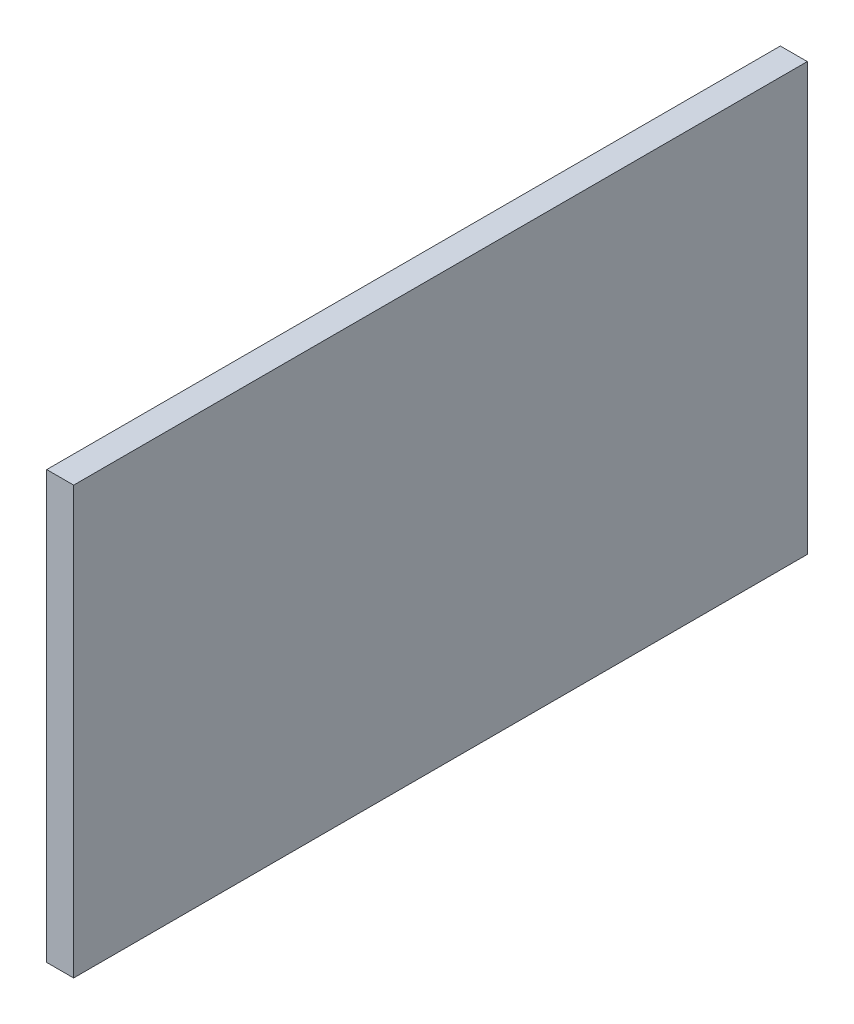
from build123d import *

# Parameters (mm, degrees)
RESSALTO_EXTRUS_O1_DEPTH = 490


with BuildPart() as part:
    # Esbo_o2 → Ressalto-extrus_o1 (new body)
    with BuildSketch(Plane.XY):
        Polygon((263, 932.602516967), (281, 932.602516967), (280.978931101, 647.5), (263, 647.5), align=None)
    extrude(amount=-RESSALTO_EXTRUS_O1_DEPTH)


solid = part.part
